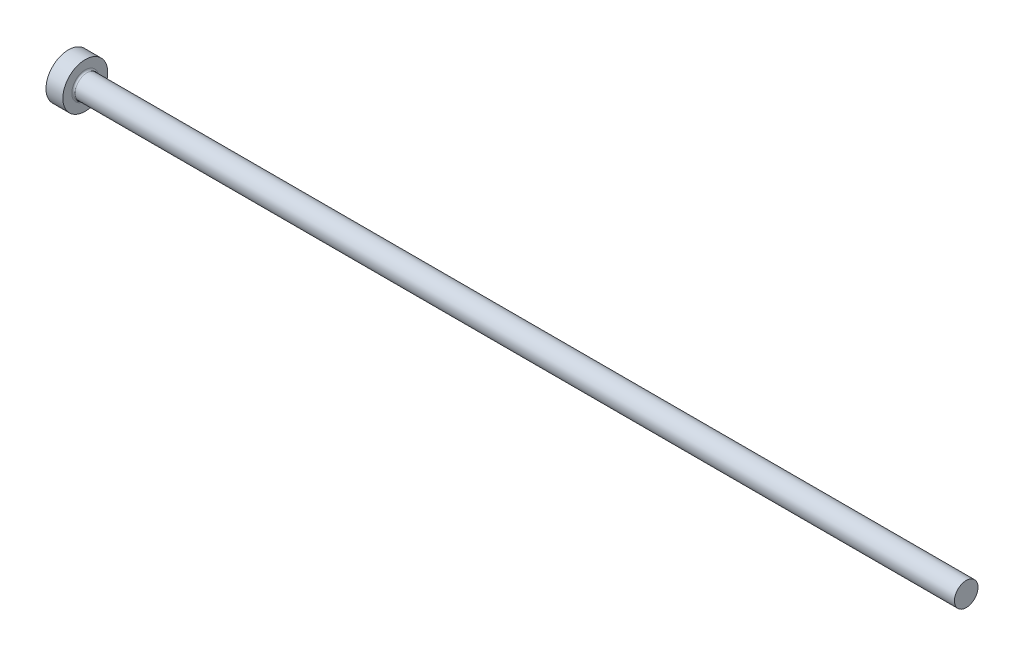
ISO-10303-21;
HEADER;
FILE_DESCRIPTION(('STEP AP214'),'2;1');
FILE_NAME('part.step','',(''),(''),'','','');
FILE_SCHEMA(('AUTOMOTIVE_DESIGN { 1 0 10303 214 1 1 1 1 }'));
ENDSEC;
DATA;
#1=APPLICATION_CONTEXT('core data for automotive mechanical design processes');
#2=APPLICATION_PROTOCOL_DEFINITION('international standard','automotive_design',2000,#1);
#3=PRODUCT_CONTEXT('',#1,'mechanical');
#4=PRODUCT('Part','Part','',(#3));
#5=PRODUCT_RELATED_PRODUCT_CATEGORY('part','',(#4));
#6=PRODUCT_DEFINITION_FORMATION('','',#4);
#7=PRODUCT_DEFINITION_CONTEXT('part definition',#1,'design');
#8=PRODUCT_DEFINITION('design','',#6,#7);
#9=PRODUCT_DEFINITION_SHAPE('','',#8);
#10=(LENGTH_UNIT() NAMED_UNIT(*) SI_UNIT(.MILLI.,.METRE.));
#11=(NAMED_UNIT(*) PLANE_ANGLE_UNIT() SI_UNIT($,.RADIAN.));
#12=(NAMED_UNIT(*) SI_UNIT($,.STERADIAN.) SOLID_ANGLE_UNIT());
#13=UNCERTAINTY_MEASURE_WITH_UNIT(LENGTH_MEASURE(1.E-05),#10,'distance_accuracy_value','');
#14=(GEOMETRIC_REPRESENTATION_CONTEXT(3) GLOBAL_UNCERTAINTY_ASSIGNED_CONTEXT((#13)) GLOBAL_UNIT_ASSIGNED_CONTEXT((#10,
#11,#12)) REPRESENTATION_CONTEXT('',''));
#15=CARTESIAN_POINT('',(0.,0.,0.));
#16=DIRECTION('',(0.,0.,1.));
#17=DIRECTION('',(1.,0.,0.));
#18=AXIS2_PLACEMENT_3D('',#15,#16,#17);
#19=CARTESIAN_POINT('',(0.,0.,0.));
#20=DIRECTION('',(-1.,0.,0.));
#21=DIRECTION('',(0.,-1.,0.));
#22=AXIS2_PLACEMENT_3D('',#19,#20,#21);
#23=PLANE('',#22);
#24=CARTESIAN_POINT('',(0.,0.,0.));
#25=DIRECTION('',(1.,0.,0.));
#26=DIRECTION('',(0.,1.,0.));
#27=AXIS2_PLACEMENT_3D('',#24,#25,#26);
#28=CIRCLE('',#27,4.);
#29=CARTESIAN_POINT('',(0.,4.,0.));
#30=VERTEX_POINT('',#29);
#31=EDGE_CURVE('E25',#30,#30,#28,.T.);
#32=ORIENTED_EDGE('',*,*,#31,.F.);
#33=EDGE_LOOP('',(#32));
#34=FACE_BOUND('',#33,.T.);
#35=ADVANCED_FACE('F14',(#34),#23,.T.);
#36=CARTESIAN_POINT('',(160.,0.,0.));
#37=DIRECTION('',(1.,0.,0.));
#38=DIRECTION('',(0.,1.,0.));
#39=AXIS2_PLACEMENT_3D('',#36,#37,#38);
#40=CYLINDRICAL_SURFACE('',#39,4.);
#41=ORIENTED_EDGE('',*,*,#31,.T.);
#42=EDGE_LOOP('',(#41));
#43=FACE_BOUND('',#42,.T.);
#44=CARTESIAN_POINT('',(3.,0.,0.));
#45=DIRECTION('',(1.,0.,0.));
#46=DIRECTION('',(0.,1.,0.));
#47=AXIS2_PLACEMENT_3D('',#44,#45,#46);
#48=CIRCLE('',#47,4.);
#49=CARTESIAN_POINT('',(3.,4.,0.));
#50=VERTEX_POINT('',#49);
#51=EDGE_CURVE('E29',#50,#50,#48,.T.);
#52=ORIENTED_EDGE('',*,*,#51,.F.);
#53=EDGE_LOOP('',(#52));
#54=FACE_BOUND('',#53,.T.);
#55=ADVANCED_FACE('F51',(#43,#54),#40,.T.);
#56=CARTESIAN_POINT('',(3.,4.,0.));
#57=DIRECTION('',(1.,0.,0.));
#58=DIRECTION('',(0.,1.,0.));
#59=AXIS2_PLACEMENT_3D('',#56,#57,#58);
#60=PLANE('',#59);
#61=CARTESIAN_POINT('',(3.,0.,0.));
#62=DIRECTION('',(1.,0.,0.));
#63=DIRECTION('',(0.,1.,0.));
#64=AXIS2_PLACEMENT_3D('',#61,#62,#63);
#65=CIRCLE('',#64,2.39999999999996);
#66=CARTESIAN_POINT('',(3.,2.39999999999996,0.));
#67=VERTEX_POINT('',#66);
#68=EDGE_CURVE('E9',#67,#67,#65,.F.);
#69=ORIENTED_EDGE('',*,*,#68,.T.);
#70=EDGE_LOOP('',(#69));
#71=FACE_BOUND('',#70,.T.);
#72=ORIENTED_EDGE('',*,*,#51,.T.);
#73=EDGE_LOOP('',(#72));
#74=FACE_BOUND('',#73,.T.);
#75=ADVANCED_FACE('F42',(#71,#74),#60,.T.);
#76=CARTESIAN_POINT('',(160.,0.,0.));
#77=DIRECTION('',(1.,0.,0.));
#78=DIRECTION('',(0.,1.,0.));
#79=AXIS2_PLACEMENT_3D('',#76,#77,#78);
#80=CYLINDRICAL_SURFACE('',#79,2.09999999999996);
#81=CARTESIAN_POINT('',(3.3,0.,0.));
#82=DIRECTION('',(1.,0.,0.));
#83=DIRECTION('',(0.,1.,0.));
#84=AXIS2_PLACEMENT_3D('',#81,#82,#83);
#85=CIRCLE('',#84,2.09999999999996);
#86=CARTESIAN_POINT('',(3.3,2.09999999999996,0.));
#87=VERTEX_POINT('',#86);
#88=EDGE_CURVE('E21',#87,#87,#85,.T.);
#89=ORIENTED_EDGE('',*,*,#88,.T.);
#90=EDGE_LOOP('',(#89));
#91=FACE_BOUND('',#90,.T.);
#92=CARTESIAN_POINT('',(160.,0.,0.));
#93=DIRECTION('',(1.,0.,0.));
#94=DIRECTION('',(0.,1.,0.));
#95=AXIS2_PLACEMENT_3D('',#92,#93,#94);
#96=CIRCLE('',#95,2.1);
#97=CARTESIAN_POINT('',(160.,2.1,0.));
#98=VERTEX_POINT('',#97);
#99=EDGE_CURVE('E34',#98,#98,#96,.T.);
#100=ORIENTED_EDGE('',*,*,#99,.F.);
#101=EDGE_LOOP('',(#100));
#102=FACE_BOUND('',#101,.T.);
#103=ADVANCED_FACE('F40',(#91,#102),#80,.T.);
#104=CARTESIAN_POINT('',(160.,2.1,0.));
#105=DIRECTION('',(1.,0.,0.));
#106=DIRECTION('',(0.,1.,0.));
#107=AXIS2_PLACEMENT_3D('',#104,#105,#106);
#108=PLANE('',#107);
#109=ORIENTED_EDGE('',*,*,#99,.T.);
#110=EDGE_LOOP('',(#109));
#111=FACE_BOUND('',#110,.T.);
#112=ADVANCED_FACE('F38',(#111),#108,.T.);
#113=CARTESIAN_POINT('',(3.3,0.,0.));
#114=DIRECTION('',(1.,0.,0.));
#115=DIRECTION('',(0.,1.,0.));
#116=AXIS2_PLACEMENT_3D('',#113,#114,#115);
#117=TOROIDAL_SURFACE('',#116,2.39999999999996,0.3);
#118=ORIENTED_EDGE('',*,*,#68,.F.);
#119=EDGE_LOOP('',(#118));
#120=FACE_BOUND('',#119,.T.);
#121=ORIENTED_EDGE('',*,*,#88,.F.);
#122=EDGE_LOOP('',(#121));
#123=FACE_BOUND('',#122,.T.);
#124=ADVANCED_FACE('F16',(#120,#123),#117,.F.);
#125=CLOSED_SHELL('',(#35,#55,#75,#103,#112,#124));
#126=MANIFOLD_SOLID_BREP('B1',#125);
#127=ADVANCED_BREP_SHAPE_REPRESENTATION('',(#18,#126),#14);
#128=SHAPE_DEFINITION_REPRESENTATION(#9,#127);
ENDSEC;
END-ISO-10303-21;
